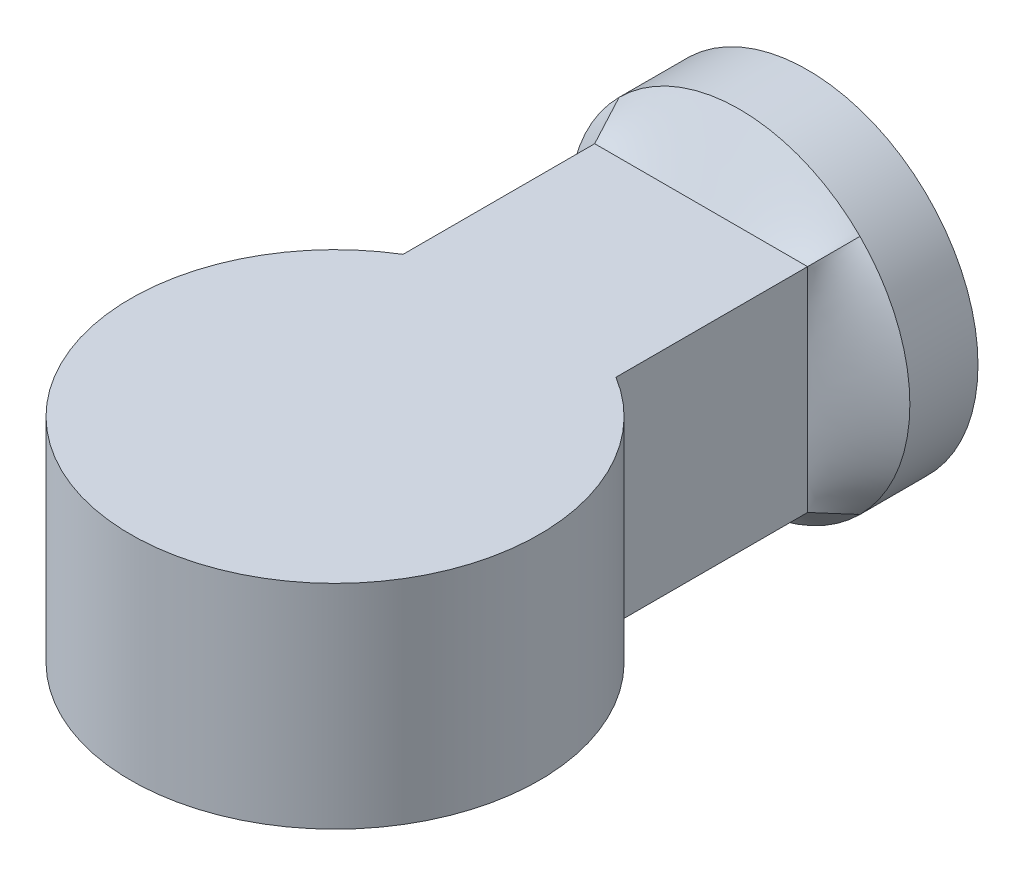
ISO-10303-21;
HEADER;
FILE_DESCRIPTION(('STEP AP214'),'2;1');
FILE_NAME('part.step','',(''),(''),'','','');
FILE_SCHEMA(('AUTOMOTIVE_DESIGN { 1 0 10303 214 1 1 1 1 }'));
ENDSEC;
DATA;
#1=APPLICATION_CONTEXT('core data for automotive mechanical design processes');
#2=APPLICATION_PROTOCOL_DEFINITION('international standard','automotive_design',2000,#1);
#3=PRODUCT_CONTEXT('',#1,'mechanical');
#4=PRODUCT('Part','Part','',(#3));
#5=PRODUCT_RELATED_PRODUCT_CATEGORY('part','',(#4));
#6=PRODUCT_DEFINITION_FORMATION('','',#4);
#7=PRODUCT_DEFINITION_CONTEXT('part definition',#1,'design');
#8=PRODUCT_DEFINITION('design','',#6,#7);
#9=PRODUCT_DEFINITION_SHAPE('','',#8);
#10=(LENGTH_UNIT() NAMED_UNIT(*) SI_UNIT(.MILLI.,.METRE.));
#11=(NAMED_UNIT(*) PLANE_ANGLE_UNIT() SI_UNIT($,.RADIAN.));
#12=(NAMED_UNIT(*) SI_UNIT($,.STERADIAN.) SOLID_ANGLE_UNIT());
#13=UNCERTAINTY_MEASURE_WITH_UNIT(LENGTH_MEASURE(1.E-05),#10,'distance_accuracy_value','');
#14=(GEOMETRIC_REPRESENTATION_CONTEXT(3) GLOBAL_UNCERTAINTY_ASSIGNED_CONTEXT((#13)) GLOBAL_UNIT_ASSIGNED_CONTEXT((#10,
#11,#12)) REPRESENTATION_CONTEXT('',''));
#15=CARTESIAN_POINT('',(0.,0.,0.));
#16=DIRECTION('',(0.,0.,1.));
#17=DIRECTION('',(1.,0.,0.));
#18=AXIS2_PLACEMENT_3D('',#15,#16,#17);
#19=CARTESIAN_POINT('',(0.,25.,0.));
#20=DIRECTION('',(0.,-1.,0.));
#21=DIRECTION('',(0.,0.,-1.));
#22=AXIS2_PLACEMENT_3D('',#19,#20,#21);
#23=CYLINDRICAL_SURFACE('',#22,48.);
#24=CARTESIAN_POINT('',(0.,-25.,0.));
#25=DIRECTION('',(0.,1.,0.));
#26=DIRECTION('',(0.,0.,1.));
#27=AXIS2_PLACEMENT_3D('',#24,#25,#26);
#28=CIRCLE('',#27,48.);
#29=CARTESIAN_POINT('',(-25.,-25.,-40.9756024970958));
#30=VERTEX_POINT('',#29);
#31=CARTESIAN_POINT('',(25.,-25.,-40.9756024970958));
#32=VERTEX_POINT('',#31);
#33=EDGE_CURVE('E102',#30,#32,#28,.T.);
#34=ORIENTED_EDGE('',*,*,#33,.T.);
#35=DIRECTION('',(0.,-1.,0.));
#36=VECTOR('',#35,1.);
#37=CARTESIAN_POINT('',(25.,25.,-40.9756024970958));
#38=LINE('',#37,#36);
#39=CARTESIAN_POINT('',(25.,25.,-40.9756024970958));
#40=VERTEX_POINT('',#39);
#41=EDGE_CURVE('E11',#40,#32,#38,.T.);
#42=ORIENTED_EDGE('',*,*,#41,.F.);
#43=CARTESIAN_POINT('',(0.,25.,0.));
#44=DIRECTION('',(0.,1.,0.));
#45=DIRECTION('',(0.,0.,1.));
#46=AXIS2_PLACEMENT_3D('',#43,#44,#45);
#47=CIRCLE('',#46,48.);
#48=CARTESIAN_POINT('',(-25.,25.,-40.9756024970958));
#49=VERTEX_POINT('',#48);
#50=EDGE_CURVE('E153',#49,#40,#47,.T.);
#51=ORIENTED_EDGE('',*,*,#50,.F.);
#52=DIRECTION('',(0.,-1.,0.));
#53=VECTOR('',#52,1.);
#54=CARTESIAN_POINT('',(-25.,25.,-40.9756024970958));
#55=LINE('',#54,#53);
#56=EDGE_CURVE('E143',#49,#30,#55,.T.);
#57=ORIENTED_EDGE('',*,*,#56,.T.);
#58=EDGE_LOOP('',(#34,#42,#51,#57));
#59=FACE_BOUND('',#58,.T.);
#60=ADVANCED_FACE('F26',(#59),#23,.T.);
#61=CARTESIAN_POINT('',(25.,25.,-40.9756024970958));
#62=DIRECTION('',(-1.,0.,0.));
#63=DIRECTION('',(0.,0.,1.));
#64=AXIS2_PLACEMENT_3D('',#61,#62,#63);
#65=PLANE('',#64);
#66=DIRECTION('',(0.,0.,-1.));
#67=VECTOR('',#66,1.);
#68=CARTESIAN_POINT('',(25.,-25.,-40.9756024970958));
#69=LINE('',#68,#67);
#70=CARTESIAN_POINT('',(25.,-25.,-85.9756024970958));
#71=VERTEX_POINT('',#70);
#72=EDGE_CURVE('E105',#32,#71,#69,.T.);
#73=ORIENTED_EDGE('',*,*,#72,.T.);
#74=DIRECTION('',(0.,-1.,0.));
#75=VECTOR('',#74,1.);
#76=CARTESIAN_POINT('',(25.,25.,-85.9756024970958));
#77=LINE('',#76,#75);
#78=CARTESIAN_POINT('',(25.,25.,-85.9756024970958));
#79=VERTEX_POINT('',#78);
#80=EDGE_CURVE('E34',#79,#71,#77,.T.);
#81=ORIENTED_EDGE('',*,*,#80,.F.);
#82=DIRECTION('',(0.,0.,-1.));
#83=VECTOR('',#82,1.);
#84=CARTESIAN_POINT('',(25.,25.,-40.9756024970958));
#85=LINE('',#84,#83);
#86=EDGE_CURVE('E151',#40,#79,#85,.T.);
#87=ORIENTED_EDGE('',*,*,#86,.F.);
#88=ORIENTED_EDGE('',*,*,#41,.T.);
#89=EDGE_LOOP('',(#73,#81,#87,#88));
#90=FACE_BOUND('',#89,.T.);
#91=ADVANCED_FACE('F157',(#90),#65,.F.);
#92=CARTESIAN_POINT('',(-25.,25.,-40.9756024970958));
#93=DIRECTION('',(1.,0.,0.));
#94=DIRECTION('',(0.,0.,-1.));
#95=AXIS2_PLACEMENT_3D('',#92,#93,#94);
#96=PLANE('',#95);
#97=DIRECTION('',(0.,0.,1.));
#98=VECTOR('',#97,1.);
#99=CARTESIAN_POINT('',(-25.,-25.,-40.9756024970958));
#100=LINE('',#99,#98);
#101=CARTESIAN_POINT('',(-25.,-25.,-85.9756024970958));
#102=VERTEX_POINT('',#101);
#103=EDGE_CURVE('E137',#102,#30,#100,.T.);
#104=ORIENTED_EDGE('',*,*,#103,.T.);
#105=ORIENTED_EDGE('',*,*,#56,.F.);
#106=DIRECTION('',(0.,0.,1.));
#107=VECTOR('',#106,1.);
#108=CARTESIAN_POINT('',(-25.,25.,-40.9756024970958));
#109=LINE('',#108,#107);
#110=CARTESIAN_POINT('',(-25.,25.,-85.9756024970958));
#111=VERTEX_POINT('',#110);
#112=EDGE_CURVE('E42',#111,#49,#109,.T.);
#113=ORIENTED_EDGE('',*,*,#112,.F.);
#114=DIRECTION('',(0.,-1.,0.));
#115=VECTOR('',#114,1.);
#116=CARTESIAN_POINT('',(-25.,25.,-85.9756024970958));
#117=LINE('',#116,#115);
#118=EDGE_CURVE('E141',#111,#102,#117,.T.);
#119=ORIENTED_EDGE('',*,*,#118,.T.);
#120=EDGE_LOOP('',(#104,#105,#113,#119));
#121=FACE_BOUND('',#120,.T.);
#122=ADVANCED_FACE('F163',(#121),#96,.F.);
#123=CARTESIAN_POINT('',(0.,25.,0.));
#124=DIRECTION('',(0.,1.,0.));
#125=DIRECTION('',(0.,0.,1.));
#126=AXIS2_PLACEMENT_3D('',#123,#124,#125);
#127=PLANE('',#126);
#128=ORIENTED_EDGE('',*,*,#50,.T.);
#129=ORIENTED_EDGE('',*,*,#86,.T.);
#130=DIRECTION('',(-1.,0.,0.));
#131=VECTOR('',#130,1.);
#132=CARTESIAN_POINT('',(-25.,25.,-85.9756024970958));
#133=LINE('',#132,#131);
#134=EDGE_CURVE('E47',#79,#111,#133,.T.);
#135=ORIENTED_EDGE('',*,*,#134,.T.);
#136=ORIENTED_EDGE('',*,*,#112,.T.);
#137=EDGE_LOOP('',(#128,#129,#135,#136));
#138=FACE_BOUND('',#137,.T.);
#139=ADVANCED_FACE('F165',(#138),#127,.T.);
#140=CARTESIAN_POINT('',(0.,-25.,0.));
#141=DIRECTION('',(0.,1.,0.));
#142=DIRECTION('',(0.,0.,1.));
#143=AXIS2_PLACEMENT_3D('',#140,#141,#142);
#144=PLANE('',#143);
#145=ORIENTED_EDGE('',*,*,#33,.F.);
#146=ORIENTED_EDGE('',*,*,#103,.F.);
#147=DIRECTION('',(-1.,0.,0.));
#148=VECTOR('',#147,1.);
#149=CARTESIAN_POINT('',(-25.,-25.,-85.9756024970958));
#150=LINE('',#149,#148);
#151=EDGE_CURVE('E133',#71,#102,#150,.T.);
#152=ORIENTED_EDGE('',*,*,#151,.F.);
#153=ORIENTED_EDGE('',*,*,#72,.F.);
#154=EDGE_LOOP('',(#145,#146,#152,#153));
#155=FACE_BOUND('',#154,.T.);
#156=ADVANCED_FACE('F160',(#155),#144,.F.);
#157=CARTESIAN_POINT('',(-25.,25.,-85.9756024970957));
#158=CARTESIAN_POINT('',(-28.2842712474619,28.2842712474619,-95.));
#159=CARTESIAN_POINT('',(-8.33333333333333,25.,-85.9756024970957));
#160=CARTESIAN_POINT('',(-11.7157287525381,44.8528137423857,-95.));
#161=CARTESIAN_POINT('',(8.33333333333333,25.,-85.9756024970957));
#162=CARTESIAN_POINT('',(11.7157287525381,44.8528137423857,-95.));
#163=CARTESIAN_POINT('',(25.,25.,-85.9756024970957));
#164=CARTESIAN_POINT('',(28.2842712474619,28.2842712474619,-95.));
#165=(BOUNDED_SURFACE() B_SPLINE_SURFACE(3,1,((#157,#158),(#159,#160),(#161,#162),(#163,#164)),
.UNSPECIFIED.,.F.,.F.,.F.) B_SPLINE_SURFACE_WITH_KNOTS((4,4),(2,2),(0.,1.),(0.,1.),
.UNSPECIFIED.) GEOMETRIC_REPRESENTATION_ITEM() RATIONAL_B_SPLINE_SURFACE(((1.,1.),(1.,
0.804737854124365),(1.,0.804737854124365),(1.,1.))) REPRESENTATION_ITEM('') SURFACE());
#166=DIRECTION('',(0.323589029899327,0.323589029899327,-0.889145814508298));
#167=VECTOR('',#166,1.);
#168=CARTESIAN_POINT('',(26.642135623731,26.642135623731,-90.4878012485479));
#169=LINE('',#168,#167);
#170=CARTESIAN_POINT('',(28.2842712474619,28.2842712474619,-95.));
#171=VERTEX_POINT('',#170);
#172=EDGE_CURVE('E96',#79,#171,#169,.T.);
#173=CARTESIAN_POINT('',(0.,0.,-95.));
#174=DIRECTION('',(0.,0.,1.));
#175=DIRECTION('',(1.,0.,0.));
#176=AXIS2_PLACEMENT_3D('',#173,#174,#175);
#177=CIRCLE('',#176,40.);
#178=CARTESIAN_POINT('',(-28.2842712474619,28.2842712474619,-95.));
#179=VERTEX_POINT('',#178);
#180=EDGE_CURVE('E78',#171,#179,#177,.T.);
#181=DIRECTION('',(0.323589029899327,-0.323589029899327,0.889145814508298));
#182=VECTOR('',#181,1.);
#183=CARTESIAN_POINT('',(-26.642135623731,26.642135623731,-90.4878012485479));
#184=LINE('',#183,#182);
#185=EDGE_CURVE('E103',#179,#111,#184,.T.);
#186=ORIENTED_EDGE('',*,*,#134,.F.);
#187=ORIENTED_EDGE('',*,*,#172,.T.);
#188=ORIENTED_EDGE('',*,*,#180,.T.);
#189=ORIENTED_EDGE('',*,*,#185,.T.);
#190=EDGE_LOOP('',(#186,#187,#188,#189));
#191=FACE_BOUND('',#190,.T.);
#192=ADVANCED_FACE('F101',(#191),#165,.T.);
#193=CARTESIAN_POINT('',(25.,25.,-85.9756024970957));
#194=CARTESIAN_POINT('',(28.2842712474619,28.2842712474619,-95.));
#195=CARTESIAN_POINT('',(25.,8.33333333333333,-85.9756024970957));
#196=CARTESIAN_POINT('',(44.8528137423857,11.7157287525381,-95.));
#197=CARTESIAN_POINT('',(25.,-8.33333333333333,-85.9756024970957));
#198=CARTESIAN_POINT('',(44.8528137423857,-11.7157287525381,-95.));
#199=CARTESIAN_POINT('',(25.,-25.,-85.9756024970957));
#200=CARTESIAN_POINT('',(28.2842712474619,-28.2842712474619,-95.));
#201=(BOUNDED_SURFACE() B_SPLINE_SURFACE(3,1,((#193,#194),(#195,#196),(#197,#198),(#199,#200)),
.UNSPECIFIED.,.F.,.F.,.F.) B_SPLINE_SURFACE_WITH_KNOTS((4,4),(2,2),(0.,1.),(0.,1.),
.UNSPECIFIED.) GEOMETRIC_REPRESENTATION_ITEM() RATIONAL_B_SPLINE_SURFACE(((1.,1.),(1.,
0.804737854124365),(1.,0.804737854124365),(1.,1.))) REPRESENTATION_ITEM('') SURFACE());
#202=DIRECTION('',(0.323589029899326,-0.323589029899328,-0.889145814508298));
#203=VECTOR('',#202,1.);
#204=CARTESIAN_POINT('',(26.6421356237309,-26.642135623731,-90.4878012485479));
#205=LINE('',#204,#203);
#206=CARTESIAN_POINT('',(28.2842712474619,-28.2842712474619,-95.));
#207=VERTEX_POINT('',#206);
#208=EDGE_CURVE('E98',#71,#207,#205,.T.);
#209=EDGE_CURVE('E81',#207,#171,#177,.T.);
#210=ORIENTED_EDGE('',*,*,#80,.T.);
#211=ORIENTED_EDGE('',*,*,#208,.T.);
#212=ORIENTED_EDGE('',*,*,#209,.T.);
#213=ORIENTED_EDGE('',*,*,#172,.F.);
#214=EDGE_LOOP('',(#210,#211,#212,#213));
#215=FACE_BOUND('',#214,.T.);
#216=ADVANCED_FACE('F95',(#215),#201,.T.);
#217=CARTESIAN_POINT('',(-25.,-25.,-85.9756024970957));
#218=CARTESIAN_POINT('',(-28.2842712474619,-28.2842712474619,-95.));
#219=CARTESIAN_POINT('',(-25.,-8.33333333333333,-85.9756024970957));
#220=CARTESIAN_POINT('',(-44.8528137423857,-11.7157287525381,-95.));
#221=CARTESIAN_POINT('',(-25.,8.33333333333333,-85.9756024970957));
#222=CARTESIAN_POINT('',(-44.8528137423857,11.7157287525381,-95.));
#223=CARTESIAN_POINT('',(-25.,25.,-85.9756024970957));
#224=CARTESIAN_POINT('',(-28.2842712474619,28.2842712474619,-95.));
#225=(BOUNDED_SURFACE() B_SPLINE_SURFACE(3,1,((#217,#218),(#219,#220),(#221,#222),(#223,#224)),
.UNSPECIFIED.,.F.,.F.,.F.) B_SPLINE_SURFACE_WITH_KNOTS((4,4),(2,2),(0.,1.),(0.,1.),
.UNSPECIFIED.) GEOMETRIC_REPRESENTATION_ITEM() RATIONAL_B_SPLINE_SURFACE(((1.,1.),(1.,
0.804737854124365),(1.,0.804737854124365),(1.,1.))) REPRESENTATION_ITEM('') SURFACE());
#226=CARTESIAN_POINT('',(-28.2842712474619,-28.2842712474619,-95.));
#227=VERTEX_POINT('',#226);
#228=EDGE_CURVE('E84',#179,#227,#177,.T.);
#229=DIRECTION('',(-0.323589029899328,-0.323589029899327,-0.889145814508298));
#230=VECTOR('',#229,1.);
#231=CARTESIAN_POINT('',(-26.642135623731,-26.642135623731,-90.4878012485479));
#232=LINE('',#231,#230);
#233=EDGE_CURVE('E125',#102,#227,#232,.T.);
#234=ORIENTED_EDGE('',*,*,#118,.F.);
#235=ORIENTED_EDGE('',*,*,#185,.F.);
#236=ORIENTED_EDGE('',*,*,#228,.T.);
#237=ORIENTED_EDGE('',*,*,#233,.F.);
#238=EDGE_LOOP('',(#234,#235,#236,#237));
#239=FACE_BOUND('',#238,.T.);
#240=ADVANCED_FACE('F140',(#239),#225,.T.);
#241=CARTESIAN_POINT('',(25.,-25.,-85.9756024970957));
#242=CARTESIAN_POINT('',(28.2842712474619,-28.2842712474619,-95.));
#243=CARTESIAN_POINT('',(8.33333333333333,-25.,-85.9756024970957));
#244=CARTESIAN_POINT('',(11.7157287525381,-44.8528137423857,-95.));
#245=CARTESIAN_POINT('',(-8.33333333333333,-25.,-85.9756024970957));
#246=CARTESIAN_POINT('',(-11.7157287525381,-44.8528137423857,-95.));
#247=CARTESIAN_POINT('',(-25.,-25.,-85.9756024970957));
#248=CARTESIAN_POINT('',(-28.2842712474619,-28.2842712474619,-95.));
#249=(BOUNDED_SURFACE() B_SPLINE_SURFACE(3,1,((#241,#242),(#243,#244),(#245,#246),(#247,#248)),
.UNSPECIFIED.,.F.,.F.,.F.) B_SPLINE_SURFACE_WITH_KNOTS((4,4),(2,2),(0.,1.),(0.,1.),
.UNSPECIFIED.) GEOMETRIC_REPRESENTATION_ITEM() RATIONAL_B_SPLINE_SURFACE(((1.,1.),(1.,
0.804737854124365),(1.,0.804737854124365),(1.,1.))) REPRESENTATION_ITEM('') SURFACE());
#250=EDGE_CURVE('E99',#227,#207,#177,.T.);
#251=ORIENTED_EDGE('',*,*,#151,.T.);
#252=ORIENTED_EDGE('',*,*,#233,.T.);
#253=ORIENTED_EDGE('',*,*,#250,.T.);
#254=ORIENTED_EDGE('',*,*,#208,.F.);
#255=EDGE_LOOP('',(#251,#252,#253,#254));
#256=FACE_BOUND('',#255,.T.);
#257=ADVANCED_FACE('F132',(#256),#249,.T.);
#258=CARTESIAN_POINT('',(0.,0.,-111.));
#259=DIRECTION('',(0.,0.,1.));
#260=DIRECTION('',(1.,0.,0.));
#261=AXIS2_PLACEMENT_3D('',#258,#259,#260);
#262=CYLINDRICAL_SURFACE('',#261,40.);
#263=CARTESIAN_POINT('',(0.,0.,-111.));
#264=DIRECTION('',(0.,0.,1.));
#265=DIRECTION('',(1.,0.,0.));
#266=AXIS2_PLACEMENT_3D('',#263,#264,#265);
#267=CIRCLE('',#266,40.);
#268=CARTESIAN_POINT('',(40.,0.,-111.));
#269=VERTEX_POINT('',#268);
#270=EDGE_CURVE('E89',#269,#269,#267,.T.);
#271=ORIENTED_EDGE('',*,*,#270,.T.);
#272=EDGE_LOOP('',(#271));
#273=FACE_BOUND('',#272,.T.);
#274=ORIENTED_EDGE('',*,*,#180,.F.);
#275=ORIENTED_EDGE('',*,*,#209,.F.);
#276=ORIENTED_EDGE('',*,*,#250,.F.);
#277=ORIENTED_EDGE('',*,*,#228,.F.);
#278=EDGE_LOOP('',(#274,#275,#276,#277));
#279=FACE_BOUND('',#278,.T.);
#280=ADVANCED_FACE('F80',(#273,#279),#262,.T.);
#281=CARTESIAN_POINT('',(0.,0.,-111.));
#282=DIRECTION('',(0.,0.,1.));
#283=DIRECTION('',(1.,0.,0.));
#284=AXIS2_PLACEMENT_3D('',#281,#282,#283);
#285=PLANE('',#284);
#286=CARTESIAN_POINT('',(0.,0.,-111.));
#287=DIRECTION('',(0.,0.,-1.));
#288=DIRECTION('',(-1.,0.,0.));
#289=AXIS2_PLACEMENT_3D('',#286,#287,#288);
#290=CIRCLE('',#289,25.);
#291=CARTESIAN_POINT('',(-25.,0.,-111.));
#292=VERTEX_POINT('',#291);
#293=EDGE_CURVE('E279',#292,#292,#290,.T.);
#294=ORIENTED_EDGE('',*,*,#293,.F.);
#295=EDGE_LOOP('',(#294));
#296=FACE_BOUND('',#295,.T.);
#297=ORIENTED_EDGE('',*,*,#270,.F.);
#298=EDGE_LOOP('',(#297));
#299=FACE_BOUND('',#298,.T.);
#300=ADVANCED_FACE('F222',(#296,#299),#285,.F.);
#301=CARTESIAN_POINT('',(0.,0.,-91.));
#302=DIRECTION('',(0.,0.,-1.));
#303=DIRECTION('',(-1.,0.,0.));
#304=AXIS2_PLACEMENT_3D('',#301,#302,#303);
#305=CYLINDRICAL_SURFACE('',#304,25.);
#306=CARTESIAN_POINT('',(0.,0.,-91.));
#307=DIRECTION('',(0.,0.,-1.));
#308=DIRECTION('',(-1.,0.,0.));
#309=AXIS2_PLACEMENT_3D('',#306,#307,#308);
#310=CIRCLE('',#309,25.);
#311=CARTESIAN_POINT('',(-25.,0.,-91.));
#312=VERTEX_POINT('',#311);
#313=EDGE_CURVE('E278',#312,#312,#310,.T.);
#314=ORIENTED_EDGE('',*,*,#313,.F.);
#315=EDGE_LOOP('',(#314));
#316=FACE_BOUND('',#315,.T.);
#317=ORIENTED_EDGE('',*,*,#293,.T.);
#318=EDGE_LOOP('',(#317));
#319=FACE_BOUND('',#318,.T.);
#320=ADVANCED_FACE('F230',(#316,#319),#305,.F.);
#321=CARTESIAN_POINT('',(0.,0.,-91.));
#322=DIRECTION('',(0.,0.,-1.));
#323=DIRECTION('',(-1.,0.,0.));
#324=AXIS2_PLACEMENT_3D('',#321,#322,#323);
#325=PLANE('',#324);
#326=ORIENTED_EDGE('',*,*,#313,.T.);
#327=EDGE_LOOP('',(#326));
#328=FACE_BOUND('',#327,.T.);
#329=ADVANCED_FACE('F238',(#328),#325,.T.);
#330=CLOSED_SHELL('',(#60,#91,#122,#139,#156,#192,#216,#240,#257,#280,#300,#320,#329));
#331=MANIFOLD_SOLID_BREP('B2',#330);
#332=ADVANCED_BREP_SHAPE_REPRESENTATION('',(#18,#331),#14);
#333=SHAPE_DEFINITION_REPRESENTATION(#9,#332);
ENDSEC;
END-ISO-10303-21;
